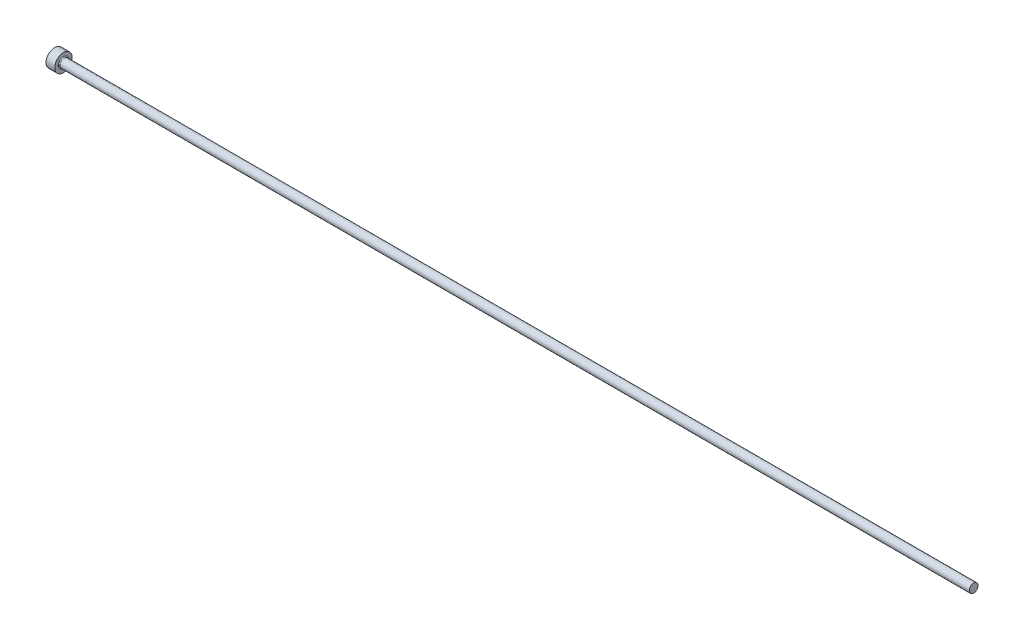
ISO-10303-21;
HEADER;
FILE_DESCRIPTION(('STEP AP214'),'2;1');
FILE_NAME('part.step','',(''),(''),'','','');
FILE_SCHEMA(('AUTOMOTIVE_DESIGN { 1 0 10303 214 1 1 1 1 }'));
ENDSEC;
DATA;
#1=APPLICATION_CONTEXT('core data for automotive mechanical design processes');
#2=APPLICATION_PROTOCOL_DEFINITION('international standard','automotive_design',2000,#1);
#3=PRODUCT_CONTEXT('',#1,'mechanical');
#4=PRODUCT('Part','Part','',(#3));
#5=PRODUCT_RELATED_PRODUCT_CATEGORY('part','',(#4));
#6=PRODUCT_DEFINITION_FORMATION('','',#4);
#7=PRODUCT_DEFINITION_CONTEXT('part definition',#1,'design');
#8=PRODUCT_DEFINITION('design','',#6,#7);
#9=PRODUCT_DEFINITION_SHAPE('','',#8);
#10=(LENGTH_UNIT() NAMED_UNIT(*) SI_UNIT(.MILLI.,.METRE.));
#11=(NAMED_UNIT(*) PLANE_ANGLE_UNIT() SI_UNIT($,.RADIAN.));
#12=(NAMED_UNIT(*) SI_UNIT($,.STERADIAN.) SOLID_ANGLE_UNIT());
#13=UNCERTAINTY_MEASURE_WITH_UNIT(LENGTH_MEASURE(1.E-05),#10,'distance_accuracy_value','');
#14=(GEOMETRIC_REPRESENTATION_CONTEXT(3) GLOBAL_UNCERTAINTY_ASSIGNED_CONTEXT((#13)) GLOBAL_UNIT_ASSIGNED_CONTEXT((#10,
#11,#12)) REPRESENTATION_CONTEXT('',''));
#15=CARTESIAN_POINT('',(0.,0.,0.));
#16=DIRECTION('',(0.,0.,1.));
#17=DIRECTION('',(1.,0.,0.));
#18=AXIS2_PLACEMENT_3D('',#15,#16,#17);
#19=CARTESIAN_POINT('',(0.,0.,0.));
#20=DIRECTION('',(-1.,0.,0.));
#21=DIRECTION('',(0.,-1.,0.));
#22=AXIS2_PLACEMENT_3D('',#19,#20,#21);
#23=PLANE('',#22);
#24=CARTESIAN_POINT('',(0.,0.,0.));
#25=DIRECTION('',(1.,0.,0.));
#26=DIRECTION('',(0.,1.,0.));
#27=AXIS2_PLACEMENT_3D('',#24,#25,#26);
#28=CIRCLE('',#27,3.);
#29=CARTESIAN_POINT('',(0.,3.,0.));
#30=VERTEX_POINT('',#29);
#31=EDGE_CURVE('E25',#30,#30,#28,.T.);
#32=ORIENTED_EDGE('',*,*,#31,.F.);
#33=EDGE_LOOP('',(#32));
#34=FACE_BOUND('',#33,.T.);
#35=ADVANCED_FACE('F14',(#34),#23,.T.);
#36=CARTESIAN_POINT('',(315.,0.,0.));
#37=DIRECTION('',(1.,0.,0.));
#38=DIRECTION('',(0.,1.,0.));
#39=AXIS2_PLACEMENT_3D('',#36,#37,#38);
#40=CYLINDRICAL_SURFACE('',#39,3.);
#41=ORIENTED_EDGE('',*,*,#31,.T.);
#42=EDGE_LOOP('',(#41));
#43=FACE_BOUND('',#42,.T.);
#44=CARTESIAN_POINT('',(3.,0.,0.));
#45=DIRECTION('',(1.,0.,0.));
#46=DIRECTION('',(0.,1.,0.));
#47=AXIS2_PLACEMENT_3D('',#44,#45,#46);
#48=CIRCLE('',#47,3.);
#49=CARTESIAN_POINT('',(3.,3.,0.));
#50=VERTEX_POINT('',#49);
#51=EDGE_CURVE('E29',#50,#50,#48,.T.);
#52=ORIENTED_EDGE('',*,*,#51,.F.);
#53=EDGE_LOOP('',(#52));
#54=FACE_BOUND('',#53,.T.);
#55=ADVANCED_FACE('F51',(#43,#54),#40,.T.);
#56=CARTESIAN_POINT('',(3.,3.,0.));
#57=DIRECTION('',(1.,0.,0.));
#58=DIRECTION('',(0.,1.,0.));
#59=AXIS2_PLACEMENT_3D('',#56,#57,#58);
#60=PLANE('',#59);
#61=CARTESIAN_POINT('',(3.,0.,0.));
#62=DIRECTION('',(1.,0.,0.));
#63=DIRECTION('',(0.,1.,0.));
#64=AXIS2_PLACEMENT_3D('',#61,#62,#63);
#65=CIRCLE('',#64,1.79999999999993);
#66=CARTESIAN_POINT('',(3.,1.79999999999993,0.));
#67=VERTEX_POINT('',#66);
#68=EDGE_CURVE('E9',#67,#67,#65,.F.);
#69=ORIENTED_EDGE('',*,*,#68,.T.);
#70=EDGE_LOOP('',(#69));
#71=FACE_BOUND('',#70,.T.);
#72=ORIENTED_EDGE('',*,*,#51,.T.);
#73=EDGE_LOOP('',(#72));
#74=FACE_BOUND('',#73,.T.);
#75=ADVANCED_FACE('F42',(#71,#74),#60,.T.);
#76=CARTESIAN_POINT('',(315.,0.,0.));
#77=DIRECTION('',(1.,0.,0.));
#78=DIRECTION('',(0.,1.,0.));
#79=AXIS2_PLACEMENT_3D('',#76,#77,#78);
#80=CYLINDRICAL_SURFACE('',#79,1.49999999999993);
#81=CARTESIAN_POINT('',(3.3,0.,0.));
#82=DIRECTION('',(1.,0.,0.));
#83=DIRECTION('',(0.,1.,0.));
#84=AXIS2_PLACEMENT_3D('',#81,#82,#83);
#85=CIRCLE('',#84,1.49999999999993);
#86=CARTESIAN_POINT('',(3.3,1.49999999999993,0.));
#87=VERTEX_POINT('',#86);
#88=EDGE_CURVE('E21',#87,#87,#85,.T.);
#89=ORIENTED_EDGE('',*,*,#88,.T.);
#90=EDGE_LOOP('',(#89));
#91=FACE_BOUND('',#90,.T.);
#92=CARTESIAN_POINT('',(315.,0.,0.));
#93=DIRECTION('',(1.,0.,0.));
#94=DIRECTION('',(0.,1.,0.));
#95=AXIS2_PLACEMENT_3D('',#92,#93,#94);
#96=CIRCLE('',#95,1.49999999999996);
#97=CARTESIAN_POINT('',(315.,1.49999999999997,0.));
#98=VERTEX_POINT('',#97);
#99=EDGE_CURVE('E34',#98,#98,#96,.T.);
#100=ORIENTED_EDGE('',*,*,#99,.F.);
#101=EDGE_LOOP('',(#100));
#102=FACE_BOUND('',#101,.T.);
#103=ADVANCED_FACE('F40',(#91,#102),#80,.T.);
#104=CARTESIAN_POINT('',(315.,1.49999999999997,0.));
#105=DIRECTION('',(1.,0.,0.));
#106=DIRECTION('',(0.,1.,0.));
#107=AXIS2_PLACEMENT_3D('',#104,#105,#106);
#108=PLANE('',#107);
#109=ORIENTED_EDGE('',*,*,#99,.T.);
#110=EDGE_LOOP('',(#109));
#111=FACE_BOUND('',#110,.T.);
#112=ADVANCED_FACE('F38',(#111),#108,.T.);
#113=CARTESIAN_POINT('',(3.3,0.,0.));
#114=DIRECTION('',(1.,0.,0.));
#115=DIRECTION('',(0.,1.,0.));
#116=AXIS2_PLACEMENT_3D('',#113,#114,#115);
#117=TOROIDAL_SURFACE('',#116,1.79999999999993,0.3);
#118=ORIENTED_EDGE('',*,*,#68,.F.);
#119=EDGE_LOOP('',(#118));
#120=FACE_BOUND('',#119,.T.);
#121=ORIENTED_EDGE('',*,*,#88,.F.);
#122=EDGE_LOOP('',(#121));
#123=FACE_BOUND('',#122,.T.);
#124=ADVANCED_FACE('F16',(#120,#123),#117,.F.);
#125=CLOSED_SHELL('',(#35,#55,#75,#103,#112,#124));
#126=MANIFOLD_SOLID_BREP('B1',#125);
#127=ADVANCED_BREP_SHAPE_REPRESENTATION('',(#18,#126),#14);
#128=SHAPE_DEFINITION_REPRESENTATION(#9,#127);
ENDSEC;
END-ISO-10303-21;
